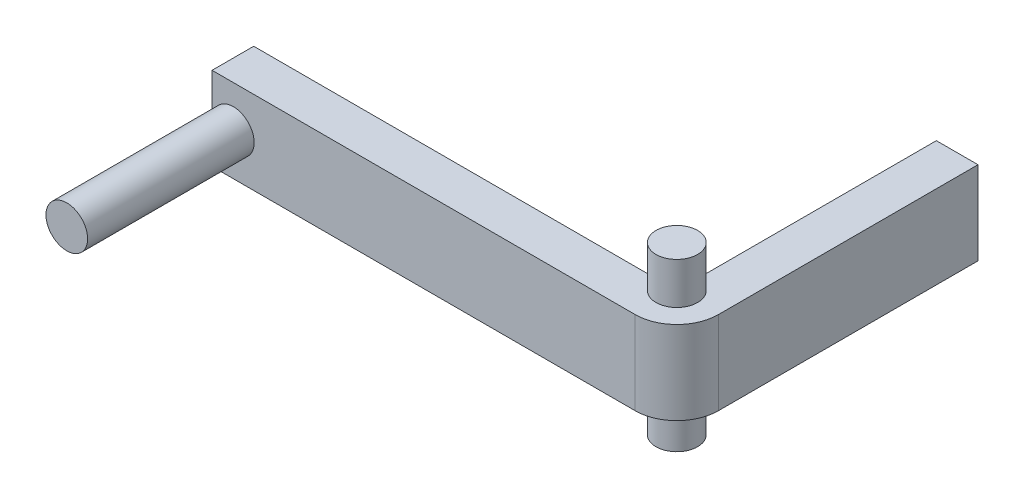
ISO-10303-21;
HEADER;
FILE_DESCRIPTION(('STEP AP214'),'2;1');
FILE_NAME('part.step','',(''),(''),'','','');
FILE_SCHEMA(('AUTOMOTIVE_DESIGN { 1 0 10303 214 1 1 1 1 }'));
ENDSEC;
DATA;
#1=APPLICATION_CONTEXT('core data for automotive mechanical design processes');
#2=APPLICATION_PROTOCOL_DEFINITION('international standard','automotive_design',2000,#1);
#3=PRODUCT_CONTEXT('',#1,'mechanical');
#4=PRODUCT('Part','Part','',(#3));
#5=PRODUCT_RELATED_PRODUCT_CATEGORY('part','',(#4));
#6=PRODUCT_DEFINITION_FORMATION('','',#4);
#7=PRODUCT_DEFINITION_CONTEXT('part definition',#1,'design');
#8=PRODUCT_DEFINITION('design','',#6,#7);
#9=PRODUCT_DEFINITION_SHAPE('','',#8);
#10=(LENGTH_UNIT() NAMED_UNIT(*) SI_UNIT(.MILLI.,.METRE.));
#11=(NAMED_UNIT(*) PLANE_ANGLE_UNIT() SI_UNIT($,.RADIAN.));
#12=(NAMED_UNIT(*) SI_UNIT($,.STERADIAN.) SOLID_ANGLE_UNIT());
#13=UNCERTAINTY_MEASURE_WITH_UNIT(LENGTH_MEASURE(1.E-05),#10,'distance_accuracy_value','');
#14=(GEOMETRIC_REPRESENTATION_CONTEXT(3) GLOBAL_UNCERTAINTY_ASSIGNED_CONTEXT((#13)) GLOBAL_UNIT_ASSIGNED_CONTEXT((#10,
#11,#12)) REPRESENTATION_CONTEXT('',''));
#15=CARTESIAN_POINT('',(0.,0.,0.));
#16=DIRECTION('',(0.,0.,1.));
#17=DIRECTION('',(1.,0.,0.));
#18=AXIS2_PLACEMENT_3D('',#15,#16,#17);
#19=CARTESIAN_POINT('',(-1.58749999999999,-1.58749999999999,0.));
#20=DIRECTION('',(-1.,0.,0.));
#21=DIRECTION('',(0.,0.,1.));
#22=AXIS2_PLACEMENT_3D('',#19,#20,#21);
#23=PLANE('',#22);
#24=DIRECTION('',(0.,1.,0.));
#25=VECTOR('',#24,1.);
#26=CARTESIAN_POINT('',(-1.58750000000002,-1.58749999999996,-2.38124999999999));
#27=LINE('',#26,#25);
#28=CARTESIAN_POINT('',(-1.58750000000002,-1.58749999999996,-2.38124999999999));
#29=VERTEX_POINT('',#28);
#30=CARTESIAN_POINT('',(-1.58750000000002,1.58750000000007,-2.38124999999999));
#31=VERTEX_POINT('',#30);
#32=EDGE_CURVE('E11',#29,#31,#27,.T.);
#33=ORIENTED_EDGE('',*,*,#32,.T.);
#34=DIRECTION('',(0.,0.,1.));
#35=VECTOR('',#34,1.);
#36=CARTESIAN_POINT('',(-1.58749999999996,1.58750000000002,0.));
#37=LINE('',#36,#35);
#38=CARTESIAN_POINT('',(-1.58749999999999,1.58750000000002,-11.4818393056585));
#39=VERTEX_POINT('',#38);
#40=EDGE_CURVE('E113',#39,#31,#37,.T.);
#41=ORIENTED_EDGE('',*,*,#40,.F.);
#42=DIRECTION('',(0.,1.,0.));
#43=VECTOR('',#42,1.);
#44=CARTESIAN_POINT('',(-1.58749999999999,-1.58749999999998,-11.4818393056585));
#45=LINE('',#44,#43);
#46=CARTESIAN_POINT('',(-1.58749999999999,-1.58749999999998,-11.4818393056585));
#47=VERTEX_POINT('',#46);
#48=EDGE_CURVE('E54',#47,#39,#45,.T.);
#49=ORIENTED_EDGE('',*,*,#48,.F.);
#50=DIRECTION('',(0.,0.,1.));
#51=VECTOR('',#50,1.);
#52=CARTESIAN_POINT('',(-1.58749999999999,-1.58749999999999,0.));
#53=LINE('',#52,#51);
#54=EDGE_CURVE('E124',#47,#29,#53,.T.);
#55=ORIENTED_EDGE('',*,*,#54,.T.);
#56=EDGE_LOOP('',(#33,#41,#49,#55));
#57=FACE_BOUND('',#56,.T.);
#58=ADVANCED_FACE('F45',(#57),#23,.T.);
#59=CARTESIAN_POINT('',(0.,-1.58749999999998,-11.4818393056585));
#60=DIRECTION('',(0.,0.,-1.));
#61=DIRECTION('',(-1.,0.,0.));
#62=AXIS2_PLACEMENT_3D('',#59,#60,#61);
#63=PLANE('',#62);
#64=ORIENTED_EDGE('',*,*,#48,.T.);
#65=DIRECTION('',(-1.,0.,0.));
#66=VECTOR('',#65,1.);
#67=CARTESIAN_POINT('',(0.,1.58750000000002,-11.4818393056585));
#68=LINE('',#67,#66);
#69=CARTESIAN_POINT('',(0.,1.58750000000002,-11.4818393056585));
#70=VERTEX_POINT('',#69);
#71=EDGE_CURVE('E121',#70,#39,#68,.T.);
#72=ORIENTED_EDGE('',*,*,#71,.F.);
#73=DIRECTION('',(0.,1.,0.));
#74=VECTOR('',#73,1.);
#75=CARTESIAN_POINT('',(0.,-1.58749999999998,-11.4818393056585));
#76=LINE('',#75,#74);
#77=CARTESIAN_POINT('',(0.,-1.58749999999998,-11.4818393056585));
#78=VERTEX_POINT('',#77);
#79=EDGE_CURVE('E168',#78,#70,#76,.T.);
#80=ORIENTED_EDGE('',*,*,#79,.F.);
#81=DIRECTION('',(-1.,0.,0.));
#82=VECTOR('',#81,1.);
#83=CARTESIAN_POINT('',(0.,-1.58749999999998,-11.4818393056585));
#84=LINE('',#83,#82);
#85=EDGE_CURVE('E164',#78,#47,#84,.T.);
#86=ORIENTED_EDGE('',*,*,#85,.T.);
#87=EDGE_LOOP('',(#64,#72,#80,#86));
#88=FACE_BOUND('',#87,.T.);
#89=ADVANCED_FACE('F196',(#88),#63,.T.);
#90=CARTESIAN_POINT('',(0.,-1.58749999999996,0.));
#91=DIRECTION('',(1.,0.,0.));
#92=DIRECTION('',(0.,0.,-1.));
#93=AXIS2_PLACEMENT_3D('',#90,#91,#92);
#94=PLANE('',#93);
#95=ORIENTED_EDGE('',*,*,#79,.T.);
#96=DIRECTION('',(0.,0.,-1.));
#97=VECTOR('',#96,1.);
#98=CARTESIAN_POINT('',(0.,1.58750000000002,0.));
#99=LINE('',#98,#97);
#100=CARTESIAN_POINT('',(0.,1.58750000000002,-1.58749999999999));
#101=VERTEX_POINT('',#100);
#102=EDGE_CURVE('E145',#101,#70,#99,.T.);
#103=ORIENTED_EDGE('',*,*,#102,.F.);
#104=DIRECTION('',(0.,1.,0.));
#105=VECTOR('',#104,1.);
#106=CARTESIAN_POINT('',(0.,-1.58749999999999,-1.58749999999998));
#107=LINE('',#106,#105);
#108=CARTESIAN_POINT('',(0.,-1.58749999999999,-1.58749999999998));
#109=VERTEX_POINT('',#108);
#110=EDGE_CURVE('E170',#109,#101,#107,.T.);
#111=ORIENTED_EDGE('',*,*,#110,.F.);
#112=DIRECTION('',(0.,0.,-1.));
#113=VECTOR('',#112,1.);
#114=CARTESIAN_POINT('',(0.,-1.58749999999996,0.));
#115=LINE('',#114,#113);
#116=EDGE_CURVE('E161',#109,#78,#115,.T.);
#117=ORIENTED_EDGE('',*,*,#116,.T.);
#118=EDGE_LOOP('',(#95,#103,#111,#117));
#119=FACE_BOUND('',#118,.T.);
#120=ADVANCED_FACE('F194',(#119),#94,.T.);
#121=CARTESIAN_POINT('',(-1.58749999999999,-1.58749999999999,-1.58749999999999));
#122=DIRECTION('',(0.,1.,0.));
#123=DIRECTION('',(0.,0.,1.));
#124=AXIS2_PLACEMENT_3D('',#121,#122,#123);
#125=CYLINDRICAL_SURFACE('',#124,1.5875);
#126=ORIENTED_EDGE('',*,*,#110,.T.);
#127=CARTESIAN_POINT('',(-1.58750000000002,1.58750000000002,-1.58749999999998));
#128=DIRECTION('',(0.,1.,0.));
#129=DIRECTION('',(0.,0.,1.));
#130=AXIS2_PLACEMENT_3D('',#127,#128,#129);
#131=CIRCLE('',#130,1.5875);
#132=CARTESIAN_POINT('',(-1.58749999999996,1.58750000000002,0.));
#133=VERTEX_POINT('',#132);
#134=EDGE_CURVE('E142',#133,#101,#131,.T.);
#135=ORIENTED_EDGE('',*,*,#134,.F.);
#136=DIRECTION('',(0.,1.,0.));
#137=VECTOR('',#136,1.);
#138=CARTESIAN_POINT('',(-1.58749999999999,-1.58749999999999,0.));
#139=LINE('',#138,#137);
#140=CARTESIAN_POINT('',(-1.58749999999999,-1.58749999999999,0.));
#141=VERTEX_POINT('',#140);
#142=EDGE_CURVE('E172',#141,#133,#139,.T.);
#143=ORIENTED_EDGE('',*,*,#142,.F.);
#144=CARTESIAN_POINT('',(-1.58749999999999,-1.58749999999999,-1.58749999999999));
#145=DIRECTION('',(0.,1.,0.));
#146=DIRECTION('',(0.,0.,1.));
#147=AXIS2_PLACEMENT_3D('',#144,#145,#146);
#148=CIRCLE('',#147,1.5875);
#149=EDGE_CURVE('E158',#141,#109,#148,.T.);
#150=ORIENTED_EDGE('',*,*,#149,.T.);
#151=EDGE_LOOP('',(#126,#135,#143,#150));
#152=FACE_BOUND('',#151,.T.);
#153=ADVANCED_FACE('F190',(#152),#125,.T.);
#154=CARTESIAN_POINT('',(0.,-1.58749999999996,0.));
#155=DIRECTION('',(0.,0.,1.));
#156=DIRECTION('',(1.,0.,0.));
#157=AXIS2_PLACEMENT_3D('',#154,#155,#156);
#158=PLANE('',#157);
#159=CARTESIAN_POINT('',(-16.9040939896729,0.,0.));
#160=DIRECTION('',(0.,0.,1.));
#161=DIRECTION('',(1.,0.,0.));
#162=AXIS2_PLACEMENT_3D('',#159,#160,#161);
#163=CIRCLE('',#162,0.793749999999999);
#164=CARTESIAN_POINT('',(-16.1103439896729,0.,0.));
#165=VERTEX_POINT('',#164);
#166=EDGE_CURVE('E251',#165,#165,#163,.T.);
#167=ORIENTED_EDGE('',*,*,#166,.F.);
#168=EDGE_LOOP('',(#167));
#169=FACE_BOUND('',#168,.T.);
#170=ORIENTED_EDGE('',*,*,#142,.T.);
#171=DIRECTION('',(1.,0.,0.));
#172=VECTOR('',#171,1.);
#173=CARTESIAN_POINT('',(0.,1.58750000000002,0.));
#174=LINE('',#173,#172);
#175=CARTESIAN_POINT('',(-17.7157432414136,1.58750000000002,0.));
#176=VERTEX_POINT('',#175);
#177=EDGE_CURVE('E139',#176,#133,#174,.T.);
#178=ORIENTED_EDGE('',*,*,#177,.F.);
#179=DIRECTION('',(0.,1.,0.));
#180=VECTOR('',#179,1.);
#181=CARTESIAN_POINT('',(-17.7157432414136,-1.58750000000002,0.));
#182=LINE('',#181,#180);
#183=CARTESIAN_POINT('',(-17.7157432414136,-1.58750000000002,0.));
#184=VERTEX_POINT('',#183);
#185=EDGE_CURVE('E174',#184,#176,#182,.T.);
#186=ORIENTED_EDGE('',*,*,#185,.F.);
#187=DIRECTION('',(1.,0.,0.));
#188=VECTOR('',#187,1.);
#189=CARTESIAN_POINT('',(0.,-1.58749999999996,0.));
#190=LINE('',#189,#188);
#191=EDGE_CURVE('E155',#184,#141,#190,.T.);
#192=ORIENTED_EDGE('',*,*,#191,.T.);
#193=EDGE_LOOP('',(#170,#178,#186,#192));
#194=FACE_BOUND('',#193,.T.);
#195=ADVANCED_FACE('F184',(#169,#194),#158,.T.);
#196=CARTESIAN_POINT('',(-17.7157432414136,-1.58750000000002,0.));
#197=DIRECTION('',(-1.,0.,0.));
#198=DIRECTION('',(0.,0.,1.));
#199=AXIS2_PLACEMENT_3D('',#196,#197,#198);
#200=PLANE('',#199);
#201=ORIENTED_EDGE('',*,*,#185,.T.);
#202=DIRECTION('',(0.,0.,1.));
#203=VECTOR('',#202,1.);
#204=CARTESIAN_POINT('',(-17.7157432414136,1.58750000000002,0.));
#205=LINE('',#204,#203);
#206=CARTESIAN_POINT('',(-17.7157432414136,1.58749999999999,-1.58749999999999));
#207=VERTEX_POINT('',#206);
#208=EDGE_CURVE('E130',#207,#176,#205,.T.);
#209=ORIENTED_EDGE('',*,*,#208,.F.);
#210=DIRECTION('',(0.,1.,0.));
#211=VECTOR('',#210,1.);
#212=CARTESIAN_POINT('',(-17.7157432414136,-1.58750000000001,-1.58749999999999));
#213=LINE('',#212,#211);
#214=CARTESIAN_POINT('',(-17.7157432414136,-1.58750000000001,-1.58749999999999));
#215=VERTEX_POINT('',#214);
#216=EDGE_CURVE('E175',#215,#207,#213,.T.);
#217=ORIENTED_EDGE('',*,*,#216,.F.);
#218=DIRECTION('',(0.,0.,1.));
#219=VECTOR('',#218,1.);
#220=CARTESIAN_POINT('',(-17.7157432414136,-1.58750000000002,0.));
#221=LINE('',#220,#219);
#222=EDGE_CURVE('E152',#215,#184,#221,.T.);
#223=ORIENTED_EDGE('',*,*,#222,.T.);
#224=EDGE_LOOP('',(#201,#209,#217,#223));
#225=FACE_BOUND('',#224,.T.);
#226=ADVANCED_FACE('F181',(#225),#200,.T.);
#227=CARTESIAN_POINT('',(0.,-1.58749999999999,-1.58749999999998));
#228=DIRECTION('',(0.,0.,-1.));
#229=DIRECTION('',(-1.,0.,0.));
#230=AXIS2_PLACEMENT_3D('',#227,#228,#229);
#231=PLANE('',#230);
#232=ORIENTED_EDGE('',*,*,#216,.T.);
#233=DIRECTION('',(-1.,0.,0.));
#234=VECTOR('',#233,1.);
#235=CARTESIAN_POINT('',(0.,1.58750000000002,-1.58749999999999));
#236=LINE('',#235,#234);
#237=CARTESIAN_POINT('',(-2.38125,1.58750000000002,-1.58749999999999));
#238=VERTEX_POINT('',#237);
#239=EDGE_CURVE('E127',#238,#207,#236,.T.);
#240=ORIENTED_EDGE('',*,*,#239,.F.);
#241=DIRECTION('',(0.,1.,0.));
#242=VECTOR('',#241,1.);
#243=CARTESIAN_POINT('',(-2.38124999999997,-1.58749999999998,-1.58749999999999));
#244=LINE('',#243,#242);
#245=CARTESIAN_POINT('',(-2.38124999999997,-1.58749999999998,-1.58749999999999));
#246=VERTEX_POINT('',#245);
#247=EDGE_CURVE('E49',#246,#238,#244,.T.);
#248=ORIENTED_EDGE('',*,*,#247,.F.);
#249=DIRECTION('',(-1.,0.,0.));
#250=VECTOR('',#249,1.);
#251=CARTESIAN_POINT('',(0.,-1.58749999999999,-1.58749999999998));
#252=LINE('',#251,#250);
#253=EDGE_CURVE('E149',#246,#215,#252,.T.);
#254=ORIENTED_EDGE('',*,*,#253,.T.);
#255=EDGE_LOOP('',(#232,#240,#248,#254));
#256=FACE_BOUND('',#255,.T.);
#257=ADVANCED_FACE('F47',(#256),#231,.T.);
#258=CARTESIAN_POINT('',(0.,-1.58749999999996,0.));
#259=DIRECTION('',(0.,1.,0.));
#260=DIRECTION('',(0.,0.,1.));
#261=AXIS2_PLACEMENT_3D('',#258,#259,#260);
#262=PLANE('',#261);
#263=CARTESIAN_POINT('',(-1.58749999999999,-1.58749999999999,-1.58749999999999));
#264=DIRECTION('',(0.,1.,0.));
#265=DIRECTION('',(0.,0.,1.));
#266=AXIS2_PLACEMENT_3D('',#263,#264,#265);
#267=CIRCLE('',#266,0.79375);
#268=EDGE_CURVE('E62',#246,#29,#267,.T.);
#269=ORIENTED_EDGE('',*,*,#268,.T.);
#270=ORIENTED_EDGE('',*,*,#54,.F.);
#271=ORIENTED_EDGE('',*,*,#85,.F.);
#272=ORIENTED_EDGE('',*,*,#116,.F.);
#273=ORIENTED_EDGE('',*,*,#149,.F.);
#274=ORIENTED_EDGE('',*,*,#191,.F.);
#275=ORIENTED_EDGE('',*,*,#222,.F.);
#276=ORIENTED_EDGE('',*,*,#253,.F.);
#277=EDGE_LOOP('',(#269,#270,#271,#272,#273,#274,#275,#276));
#278=FACE_BOUND('',#277,.T.);
#279=ADVANCED_FACE('F186',(#278),#262,.F.);
#280=CARTESIAN_POINT('',(0.,1.58750000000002,0.));
#281=DIRECTION('',(0.,1.,0.));
#282=DIRECTION('',(0.,0.,1.));
#283=AXIS2_PLACEMENT_3D('',#280,#281,#282);
#284=PLANE('',#283);
#285=CARTESIAN_POINT('',(-1.58750000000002,1.58750000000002,-1.58749999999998));
#286=DIRECTION('',(0.,1.,0.));
#287=DIRECTION('',(0.,0.,1.));
#288=AXIS2_PLACEMENT_3D('',#285,#286,#287);
#289=CIRCLE('',#288,0.79375);
#290=EDGE_CURVE('E117',#238,#31,#289,.T.);
#291=ORIENTED_EDGE('',*,*,#290,.F.);
#292=ORIENTED_EDGE('',*,*,#239,.T.);
#293=ORIENTED_EDGE('',*,*,#208,.T.);
#294=ORIENTED_EDGE('',*,*,#177,.T.);
#295=ORIENTED_EDGE('',*,*,#134,.T.);
#296=ORIENTED_EDGE('',*,*,#102,.T.);
#297=ORIENTED_EDGE('',*,*,#71,.T.);
#298=ORIENTED_EDGE('',*,*,#40,.T.);
#299=EDGE_LOOP('',(#291,#292,#293,#294,#295,#296,#297,#298));
#300=FACE_BOUND('',#299,.T.);
#301=ADVANCED_FACE('F114',(#300),#284,.T.);
#302=CARTESIAN_POINT('',(-1.58749999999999,-3.17499999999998,-1.58749999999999));
#303=DIRECTION('',(0.,1.,0.));
#304=DIRECTION('',(0.,0.,1.));
#305=AXIS2_PLACEMENT_3D('',#302,#303,#304);
#306=CYLINDRICAL_SURFACE('',#305,0.79375);
#307=CARTESIAN_POINT('',(-1.58750000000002,3.17500000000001,-1.58749999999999));
#308=DIRECTION('',(0.,1.,0.));
#309=DIRECTION('',(0.,0.,1.));
#310=AXIS2_PLACEMENT_3D('',#307,#308,#309);
#311=CIRCLE('',#310,0.79375);
#312=CARTESIAN_POINT('',(-1.58750000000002,3.17500000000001,-0.793749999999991));
#313=VERTEX_POINT('',#312);
#314=EDGE_CURVE('E133',#313,#313,#311,.T.);
#315=ORIENTED_EDGE('',*,*,#314,.F.);
#316=EDGE_LOOP('',(#315));
#317=FACE_BOUND('',#316,.T.);
#318=CARTESIAN_POINT('',(-1.58749999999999,-3.17499999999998,-1.58749999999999));
#319=DIRECTION('',(0.,1.,0.));
#320=DIRECTION('',(0.,0.,1.));
#321=AXIS2_PLACEMENT_3D('',#318,#319,#320);
#322=CIRCLE('',#321,0.79375);
#323=CARTESIAN_POINT('',(-1.58749999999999,-3.17499999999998,-0.793749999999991));
#324=VERTEX_POINT('',#323);
#325=EDGE_CURVE('E128',#324,#324,#322,.T.);
#326=ORIENTED_EDGE('',*,*,#325,.T.);
#327=EDGE_LOOP('',(#326));
#328=FACE_BOUND('',#327,.T.);
#329=ORIENTED_EDGE('',*,*,#268,.F.);
#330=ORIENTED_EDGE('',*,*,#247,.T.);
#331=ORIENTED_EDGE('',*,*,#290,.T.);
#332=ORIENTED_EDGE('',*,*,#32,.F.);
#333=EDGE_LOOP('',(#329,#330,#331,#332));
#334=FACE_BOUND('',#333,.T.);
#335=ADVANCED_FACE('F126',(#317,#328,#334),#306,.T.);
#336=CARTESIAN_POINT('',(-1.58749999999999,-3.17499999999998,-1.58749999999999));
#337=DIRECTION('',(0.,1.,0.));
#338=DIRECTION('',(0.,0.,1.));
#339=AXIS2_PLACEMENT_3D('',#336,#337,#338);
#340=PLANE('',#339);
#341=ORIENTED_EDGE('',*,*,#325,.F.);
#342=EDGE_LOOP('',(#341));
#343=FACE_BOUND('',#342,.T.);
#344=ADVANCED_FACE('F229',(#343),#340,.F.);
#345=CARTESIAN_POINT('',(-1.58750000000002,3.17500000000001,-1.58749999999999));
#346=DIRECTION('',(0.,1.,0.));
#347=DIRECTION('',(0.,0.,1.));
#348=AXIS2_PLACEMENT_3D('',#345,#346,#347);
#349=PLANE('',#348);
#350=ORIENTED_EDGE('',*,*,#314,.T.);
#351=EDGE_LOOP('',(#350));
#352=FACE_BOUND('',#351,.T.);
#353=ADVANCED_FACE('F233',(#352),#349,.T.);
#354=CARTESIAN_POINT('',(-16.9040939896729,0.,6.35000000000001));
#355=DIRECTION('',(0.,0.,-1.));
#356=DIRECTION('',(-1.,0.,0.));
#357=AXIS2_PLACEMENT_3D('',#354,#355,#356);
#358=CYLINDRICAL_SURFACE('',#357,0.793749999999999);
#359=CARTESIAN_POINT('',(-16.9040939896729,0.,6.35000000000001));
#360=DIRECTION('',(0.,0.,1.));
#361=DIRECTION('',(1.,0.,0.));
#362=AXIS2_PLACEMENT_3D('',#359,#360,#361);
#363=CIRCLE('',#362,0.793749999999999);
#364=CARTESIAN_POINT('',(-16.1103439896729,0.,6.35000000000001));
#365=VERTEX_POINT('',#364);
#366=EDGE_CURVE('E250',#365,#365,#363,.T.);
#367=ORIENTED_EDGE('',*,*,#366,.F.);
#368=EDGE_LOOP('',(#367));
#369=FACE_BOUND('',#368,.T.);
#370=ORIENTED_EDGE('',*,*,#166,.T.);
#371=EDGE_LOOP('',(#370));
#372=FACE_BOUND('',#371,.T.);
#373=ADVANCED_FACE('F237',(#369,#372),#358,.T.);
#374=CARTESIAN_POINT('',(-16.9040939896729,0.,6.35000000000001));
#375=DIRECTION('',(0.,0.,1.));
#376=DIRECTION('',(1.,0.,0.));
#377=AXIS2_PLACEMENT_3D('',#374,#375,#376);
#378=PLANE('',#377);
#379=ORIENTED_EDGE('',*,*,#366,.T.);
#380=EDGE_LOOP('',(#379));
#381=FACE_BOUND('',#380,.T.);
#382=ADVANCED_FACE('F241',(#381),#378,.T.);
#383=CLOSED_SHELL('',(#58,#89,#120,#153,#195,#226,#257,#279,#301,#335,#344,#353,#373,#382));
#384=MANIFOLD_SOLID_BREP('B2',#383);
#385=ADVANCED_BREP_SHAPE_REPRESENTATION('',(#18,#384),#14);
#386=SHAPE_DEFINITION_REPRESENTATION(#9,#385);
ENDSEC;
END-ISO-10303-21;
